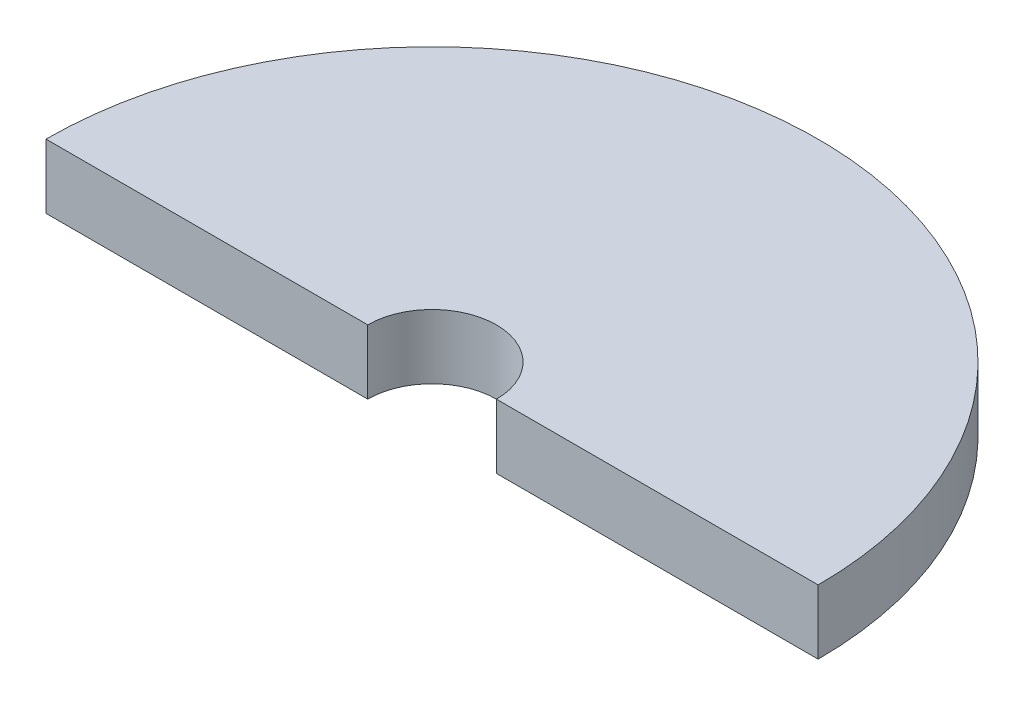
from build123d import *

# Parameters (mm, degrees)
ESQUISSE1_R      = 6
ESQUISSE1_R_2    = 1
EXTRUSION1_DEPTH = 1
ESQUISSE2_W      = 6
ESQUISSE2_H      = 1
COUPE_ANGLE      = 180


with BuildPart() as part:
    # Esquisse1 → Extrusion1 (new body)
    with BuildSketch(Plane(origin=(0, 0, 0), x_dir=(1, 0, 0), z_dir=(0, 1, 0))):
        Circle(ESQUISSE1_R)
        Circle(ESQUISSE1_R_2, mode=Mode.SUBTRACT)
    extrude(amount=EXTRUSION1_DEPTH)

    # Esquisse2 → Coupe (revolve, cut)
    with BuildSketch(Plane.XY):
        with Locations((3, 0.5)):
            Rectangle(ESQUISSE2_W, ESQUISSE2_H)
    revolve(axis=Axis((0, 4.670837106, 0), (0, -1, 0)), revolution_arc=COUPE_ANGLE, mode=Mode.SUBTRACT)


solid = part.part
